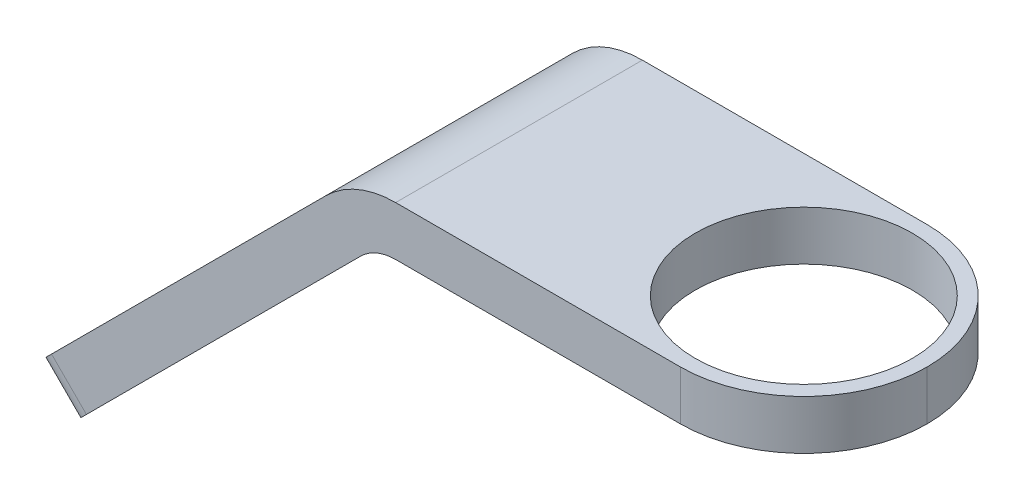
ISO-10303-21;
HEADER;
FILE_DESCRIPTION(('STEP AP214'),'2;1');
FILE_NAME('part.step','',(''),(''),'','','');
FILE_SCHEMA(('AUTOMOTIVE_DESIGN { 1 0 10303 214 1 1 1 1 }'));
ENDSEC;
DATA;
#1=APPLICATION_CONTEXT('core data for automotive mechanical design processes');
#2=APPLICATION_PROTOCOL_DEFINITION('international standard','automotive_design',2000,#1);
#3=PRODUCT_CONTEXT('',#1,'mechanical');
#4=PRODUCT('Part','Part','',(#3));
#5=PRODUCT_RELATED_PRODUCT_CATEGORY('part','',(#4));
#6=PRODUCT_DEFINITION_FORMATION('','',#4);
#7=PRODUCT_DEFINITION_CONTEXT('part definition',#1,'design');
#8=PRODUCT_DEFINITION('design','',#6,#7);
#9=PRODUCT_DEFINITION_SHAPE('','',#8);
#10=(LENGTH_UNIT() NAMED_UNIT(*) SI_UNIT(.MILLI.,.METRE.));
#11=(NAMED_UNIT(*) PLANE_ANGLE_UNIT() SI_UNIT($,.RADIAN.));
#12=(NAMED_UNIT(*) SI_UNIT($,.STERADIAN.) SOLID_ANGLE_UNIT());
#13=UNCERTAINTY_MEASURE_WITH_UNIT(LENGTH_MEASURE(1.E-05),#10,'distance_accuracy_value','');
#14=(GEOMETRIC_REPRESENTATION_CONTEXT(3) GLOBAL_UNCERTAINTY_ASSIGNED_CONTEXT((#13)) GLOBAL_UNIT_ASSIGNED_CONTEXT((#10,
#11,#12)) REPRESENTATION_CONTEXT('',''));
#15=CARTESIAN_POINT('',(0.,0.,0.));
#16=DIRECTION('',(0.,0.,1.));
#17=DIRECTION('',(1.,0.,0.));
#18=AXIS2_PLACEMENT_3D('',#15,#16,#17);
#19=CARTESIAN_POINT('',(0.,0.,50.));
#20=DIRECTION('',(0.707106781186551,0.707106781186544,0.));
#21=DIRECTION('',(-0.707106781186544,0.707106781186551,0.));
#22=AXIS2_PLACEMENT_3D('',#19,#20,#21);
#23=PLANE('',#22);
#24=DIRECTION('',(0.,0.,-1.));
#25=VECTOR('',#24,1.);
#26=CARTESIAN_POINT('',(0.,0.,50.));
#27=LINE('',#26,#25);
#28=CARTESIAN_POINT('',(0.,0.,45.));
#29=VERTEX_POINT('',#28);
#30=CARTESIAN_POINT('',(0.,0.,5.));
#31=VERTEX_POINT('',#30);
#32=EDGE_CURVE('E189',#29,#31,#27,.T.);
#33=ORIENTED_EDGE('',*,*,#32,.T.);
#34=DIRECTION('',(0.707106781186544,-0.707106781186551,0.));
#35=VECTOR('',#34,1.);
#36=CARTESIAN_POINT('',(0.,0.,5.));
#37=LINE('',#36,#35);
#38=CARTESIAN_POINT('',(7.07106781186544,-7.07106781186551,5.));
#39=VERTEX_POINT('',#38);
#40=EDGE_CURVE('E178',#31,#39,#37,.T.);
#41=ORIENTED_EDGE('',*,*,#40,.T.);
#42=DIRECTION('',(0.,0.,-1.));
#43=VECTOR('',#42,1.);
#44=CARTESIAN_POINT('',(7.07106781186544,-7.07106781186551,50.));
#45=LINE('',#44,#43);
#46=CARTESIAN_POINT('',(7.07106781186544,-7.07106781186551,45.));
#47=VERTEX_POINT('',#46);
#48=EDGE_CURVE('E196',#47,#39,#45,.T.);
#49=ORIENTED_EDGE('',*,*,#48,.F.);
#50=DIRECTION('',(0.707106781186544,-0.707106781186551,0.));
#51=VECTOR('',#50,1.);
#52=CARTESIAN_POINT('',(0.,0.,45.));
#53=LINE('',#52,#51);
#54=EDGE_CURVE('E176',#47,#29,#53,.F.);
#55=ORIENTED_EDGE('',*,*,#54,.T.);
#56=EDGE_LOOP('',(#33,#41,#49,#55));
#57=FACE_BOUND('',#56,.T.);
#58=ADVANCED_FACE('F33',(#57),#23,.F.);
#59=CARTESIAN_POINT('',(7.07106781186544,-7.07106781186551,50.));
#60=DIRECTION('',(-0.707106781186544,0.707106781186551,0.));
#61=DIRECTION('',(-0.707106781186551,-0.707106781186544,0.));
#62=AXIS2_PLACEMENT_3D('',#59,#60,#61);
#63=PLANE('',#62);
#64=ORIENTED_EDGE('',*,*,#48,.T.);
#65=CARTESIAN_POINT('',(10.6066017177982,-3.53553390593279,5.));
#66=DIRECTION('',(-0.707106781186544,0.707106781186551,0.));
#67=DIRECTION('',(-0.707106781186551,-0.707106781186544,0.));
#68=AXIS2_PLACEMENT_3D('',#65,#66,#67);
#69=CIRCLE('',#68,5.);
#70=CARTESIAN_POINT('',(10.6066017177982,-3.53553390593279,0.));
#71=VERTEX_POINT('',#70);
#72=EDGE_CURVE('E183',#39,#71,#69,.F.);
#73=ORIENTED_EDGE('',*,*,#72,.T.);
#74=DIRECTION('',(0.707106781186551,0.707106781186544,0.));
#75=VECTOR('',#74,1.);
#76=CARTESIAN_POINT('',(7.07106781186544,-7.07106781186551,0.));
#77=LINE('',#76,#75);
#78=CARTESIAN_POINT('',(66.2132034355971,52.0710678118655,0.));
#79=VERTEX_POINT('',#78);
#80=EDGE_CURVE('E156',#71,#79,#77,.T.);
#81=ORIENTED_EDGE('',*,*,#80,.T.);
#82=DIRECTION('',(0.,0.,-1.));
#83=VECTOR('',#82,1.);
#84=CARTESIAN_POINT('',(66.2132034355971,52.0710678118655,50.));
#85=LINE('',#84,#83);
#86=CARTESIAN_POINT('',(66.2132034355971,52.0710678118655,50.));
#87=VERTEX_POINT('',#86);
#88=EDGE_CURVE('E168',#79,#87,#85,.F.);
#89=ORIENTED_EDGE('',*,*,#88,.T.);
#90=DIRECTION('',(0.707106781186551,0.707106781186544,0.));
#91=VECTOR('',#90,1.);
#92=CARTESIAN_POINT('',(7.07106781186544,-7.07106781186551,50.));
#93=LINE('',#92,#91);
#94=CARTESIAN_POINT('',(10.6066017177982,-3.53553390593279,50.));
#95=VERTEX_POINT('',#94);
#96=EDGE_CURVE('E208',#95,#87,#93,.T.);
#97=ORIENTED_EDGE('',*,*,#96,.F.);
#98=CARTESIAN_POINT('',(10.6066017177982,-3.53553390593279,45.));
#99=DIRECTION('',(-0.707106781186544,0.707106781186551,0.));
#100=DIRECTION('',(-0.707106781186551,-0.707106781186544,0.));
#101=AXIS2_PLACEMENT_3D('',#98,#99,#100);
#102=CIRCLE('',#101,5.);
#103=EDGE_CURVE('E181',#95,#47,#102,.F.);
#104=ORIENTED_EDGE('',*,*,#103,.T.);
#105=EDGE_LOOP('',(#64,#73,#81,#89,#97,#104));
#106=FACE_BOUND('',#105,.T.);
#107=ADVANCED_FACE('F201',(#106),#63,.F.);
#108=CARTESIAN_POINT('',(156.000000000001,55.,50.));
#109=DIRECTION('',(0.,1.,0.));
#110=DIRECTION('',(-1.,0.,0.));
#111=AXIS2_PLACEMENT_3D('',#108,#109,#110);
#112=PLANE('',#111);
#113=CARTESIAN_POINT('',(131.000000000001,55.,25.));
#114=DIRECTION('',(0.,1.,0.));
#115=DIRECTION('',(-1.,0.,0.));
#116=AXIS2_PLACEMENT_3D('',#113,#114,#115);
#117=CIRCLE('',#116,22.);
#118=CARTESIAN_POINT('',(109.000000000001,55.,25.));
#119=VERTEX_POINT('',#118);
#120=EDGE_CURVE('E157',#119,#119,#117,.T.);
#121=ORIENTED_EDGE('',*,*,#120,.T.);
#122=EDGE_LOOP('',(#121));
#123=FACE_BOUND('',#122,.T.);
#124=DIRECTION('',(1.,0.,0.));
#125=VECTOR('',#124,1.);
#126=CARTESIAN_POINT('',(156.000000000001,55.,50.));
#127=LINE('',#126,#125);
#128=CARTESIAN_POINT('',(73.2842712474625,55.,50.));
#129=VERTEX_POINT('',#128);
#130=CARTESIAN_POINT('',(131.000000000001,55.,50.));
#131=VERTEX_POINT('',#130);
#132=EDGE_CURVE('E210',#129,#131,#127,.T.);
#133=ORIENTED_EDGE('',*,*,#132,.F.);
#134=DIRECTION('',(0.,0.,-1.));
#135=VECTOR('',#134,1.);
#136=CARTESIAN_POINT('',(73.2842712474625,55.,0.));
#137=LINE('',#136,#135);
#138=CARTESIAN_POINT('',(73.2842712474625,55.,0.));
#139=VERTEX_POINT('',#138);
#140=EDGE_CURVE('E165',#129,#139,#137,.T.);
#141=ORIENTED_EDGE('',*,*,#140,.T.);
#142=DIRECTION('',(1.,0.,0.));
#143=VECTOR('',#142,1.);
#144=CARTESIAN_POINT('',(156.000000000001,55.,0.));
#145=LINE('',#144,#143);
#146=CARTESIAN_POINT('',(131.000000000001,55.,0.));
#147=VERTEX_POINT('',#146);
#148=EDGE_CURVE('E139',#139,#147,#145,.T.);
#149=ORIENTED_EDGE('',*,*,#148,.T.);
#150=CARTESIAN_POINT('',(131.000000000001,55.,25.));
#151=DIRECTION('',(0.,1.,0.));
#152=DIRECTION('',(-1.,0.,0.));
#153=AXIS2_PLACEMENT_3D('',#150,#151,#152);
#154=CIRCLE('',#153,25.);
#155=CARTESIAN_POINT('',(156.000000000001,55.,25.));
#156=VERTEX_POINT('',#155);
#157=EDGE_CURVE('E143',#147,#156,#154,.F.);
#158=ORIENTED_EDGE('',*,*,#157,.T.);
#159=CARTESIAN_POINT('',(131.000000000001,55.,25.));
#160=DIRECTION('',(0.,1.,0.));
#161=DIRECTION('',(-1.,0.,0.));
#162=AXIS2_PLACEMENT_3D('',#159,#160,#161);
#163=CIRCLE('',#162,25.);
#164=EDGE_CURVE('E144',#156,#131,#163,.F.);
#165=ORIENTED_EDGE('',*,*,#164,.T.);
#166=EDGE_LOOP('',(#133,#141,#149,#158,#165));
#167=FACE_BOUND('',#166,.T.);
#168=ADVANCED_FACE('F230',(#123,#167),#112,.F.);
#169=CARTESIAN_POINT('',(156.000000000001,65.,50.));
#170=DIRECTION('',(0.,-1.,0.));
#171=DIRECTION('',(1.,0.,0.));
#172=AXIS2_PLACEMENT_3D('',#169,#170,#171);
#173=PLANE('',#172);
#174=CARTESIAN_POINT('',(131.000000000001,65.,25.));
#175=DIRECTION('',(0.,1.,0.));
#176=DIRECTION('',(0.,0.,1.));
#177=AXIS2_PLACEMENT_3D('',#174,#175,#176);
#178=CIRCLE('',#177,22.);
#179=CARTESIAN_POINT('',(131.000000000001,65.,47.));
#180=VERTEX_POINT('',#179);
#181=EDGE_CURVE('E278',#180,#180,#178,.T.);
#182=ORIENTED_EDGE('',*,*,#181,.F.);
#183=EDGE_LOOP('',(#182));
#184=FACE_BOUND('',#183,.T.);
#185=DIRECTION('',(-1.,0.,0.));
#186=VECTOR('',#185,1.);
#187=CARTESIAN_POINT('',(156.000000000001,65.,0.));
#188=LINE('',#187,#186);
#189=CARTESIAN_POINT('',(131.000000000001,65.,0.));
#190=VERTEX_POINT('',#189);
#191=CARTESIAN_POINT('',(73.2842712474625,65.,0.));
#192=VERTEX_POINT('',#191);
#193=EDGE_CURVE('E123',#190,#192,#188,.T.);
#194=ORIENTED_EDGE('',*,*,#193,.T.);
#195=DIRECTION('',(0.,0.,-1.));
#196=VECTOR('',#195,1.);
#197=CARTESIAN_POINT('',(73.2842712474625,65.,50.));
#198=LINE('',#197,#196);
#199=CARTESIAN_POINT('',(73.2842712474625,65.,50.));
#200=VERTEX_POINT('',#199);
#201=EDGE_CURVE('E161',#192,#200,#198,.F.);
#202=ORIENTED_EDGE('',*,*,#201,.T.);
#203=DIRECTION('',(-1.,0.,0.));
#204=VECTOR('',#203,1.);
#205=CARTESIAN_POINT('',(156.000000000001,65.,50.));
#206=LINE('',#205,#204);
#207=CARTESIAN_POINT('',(131.000000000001,65.,50.));
#208=VERTEX_POINT('',#207);
#209=EDGE_CURVE('E214',#208,#200,#206,.T.);
#210=ORIENTED_EDGE('',*,*,#209,.F.);
#211=CARTESIAN_POINT('',(131.000000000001,65.,25.));
#212=DIRECTION('',(0.,-1.,0.));
#213=DIRECTION('',(1.,0.,0.));
#214=AXIS2_PLACEMENT_3D('',#211,#212,#213);
#215=CIRCLE('',#214,25.);
#216=CARTESIAN_POINT('',(156.000000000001,65.,25.));
#217=VERTEX_POINT('',#216);
#218=EDGE_CURVE('E127',#208,#217,#215,.F.);
#219=ORIENTED_EDGE('',*,*,#218,.T.);
#220=CARTESIAN_POINT('',(131.000000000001,65.,25.));
#221=DIRECTION('',(0.,-1.,0.));
#222=DIRECTION('',(1.,0.,0.));
#223=AXIS2_PLACEMENT_3D('',#220,#221,#222);
#224=CIRCLE('',#223,25.);
#225=EDGE_CURVE('E120',#217,#190,#224,.F.);
#226=ORIENTED_EDGE('',*,*,#225,.T.);
#227=EDGE_LOOP('',(#194,#202,#210,#219,#226));
#228=FACE_BOUND('',#227,.T.);
#229=ADVANCED_FACE('F122',(#184,#228),#173,.F.);
#230=CARTESIAN_POINT('',(0.,0.,50.));
#231=DIRECTION('',(0.707106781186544,-0.707106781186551,0.));
#232=DIRECTION('',(0.707106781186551,0.707106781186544,0.));
#233=AXIS2_PLACEMENT_3D('',#230,#231,#232);
#234=PLANE('',#233);
#235=DIRECTION('',(-0.707106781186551,-0.707106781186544,0.));
#236=VECTOR('',#235,1.);
#237=CARTESIAN_POINT('',(0.,0.,0.));
#238=LINE('',#237,#236);
#239=CARTESIAN_POINT('',(59.1421356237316,59.142135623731,0.));
#240=VERTEX_POINT('',#239);
#241=CARTESIAN_POINT('',(3.53553390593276,3.53553390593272,0.));
#242=VERTEX_POINT('',#241);
#243=EDGE_CURVE('E138',#240,#242,#238,.T.);
#244=ORIENTED_EDGE('',*,*,#243,.T.);
#245=CARTESIAN_POINT('',(3.53553390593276,3.53553390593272,5.));
#246=DIRECTION('',(0.707106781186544,-0.707106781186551,0.));
#247=DIRECTION('',(0.707106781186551,0.707106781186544,0.));
#248=AXIS2_PLACEMENT_3D('',#245,#246,#247);
#249=CIRCLE('',#248,5.);
#250=EDGE_CURVE('E41',#242,#31,#249,.F.);
#251=ORIENTED_EDGE('',*,*,#250,.T.);
#252=ORIENTED_EDGE('',*,*,#32,.F.);
#253=CARTESIAN_POINT('',(3.53553390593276,3.53553390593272,45.));
#254=DIRECTION('',(0.707106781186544,-0.707106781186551,0.));
#255=DIRECTION('',(0.707106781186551,0.707106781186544,0.));
#256=AXIS2_PLACEMENT_3D('',#253,#254,#255);
#257=CIRCLE('',#256,5.);
#258=CARTESIAN_POINT('',(3.53553390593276,3.53553390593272,50.));
#259=VERTEX_POINT('',#258);
#260=EDGE_CURVE('E48',#29,#259,#257,.F.);
#261=ORIENTED_EDGE('',*,*,#260,.T.);
#262=DIRECTION('',(-0.707106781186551,-0.707106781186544,0.));
#263=VECTOR('',#262,1.);
#264=CARTESIAN_POINT('',(0.,0.,50.));
#265=LINE('',#264,#263);
#266=CARTESIAN_POINT('',(59.1421356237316,59.142135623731,50.));
#267=VERTEX_POINT('',#266);
#268=EDGE_CURVE('E197',#267,#259,#265,.T.);
#269=ORIENTED_EDGE('',*,*,#268,.F.);
#270=DIRECTION('',(0.,0.,-1.));
#271=VECTOR('',#270,1.);
#272=CARTESIAN_POINT('',(59.1421356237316,59.142135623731,50.));
#273=LINE('',#272,#271);
#274=EDGE_CURVE('E153',#267,#240,#273,.T.);
#275=ORIENTED_EDGE('',*,*,#274,.T.);
#276=EDGE_LOOP('',(#244,#251,#252,#261,#269,#275));
#277=FACE_BOUND('',#276,.T.);
#278=ADVANCED_FACE('F188',(#277),#234,.F.);
#279=CARTESIAN_POINT('',(0.,0.,50.));
#280=DIRECTION('',(0.,0.,1.));
#281=DIRECTION('',(1.,0.,0.));
#282=AXIS2_PLACEMENT_3D('',#279,#280,#281);
#283=PLANE('',#282);
#284=ORIENTED_EDGE('',*,*,#268,.T.);
#285=DIRECTION('',(0.707106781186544,-0.707106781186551,0.));
#286=VECTOR('',#285,1.);
#287=CARTESIAN_POINT('',(10.6066017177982,-3.53553390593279,50.));
#288=LINE('',#287,#286);
#289=EDGE_CURVE('E11',#259,#95,#288,.T.);
#290=ORIENTED_EDGE('',*,*,#289,.T.);
#291=ORIENTED_EDGE('',*,*,#96,.T.);
#292=CARTESIAN_POINT('',(73.2842712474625,45.,50.));
#293=DIRECTION('',(0.,0.,1.));
#294=DIRECTION('',(1.,0.,0.));
#295=AXIS2_PLACEMENT_3D('',#292,#293,#294);
#296=CIRCLE('',#295,10.);
#297=EDGE_CURVE('E174',#87,#129,#296,.F.);
#298=ORIENTED_EDGE('',*,*,#297,.T.);
#299=ORIENTED_EDGE('',*,*,#132,.T.);
#300=DIRECTION('',(0.,1.,0.));
#301=VECTOR('',#300,1.);
#302=CARTESIAN_POINT('',(131.000000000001,65.,50.));
#303=LINE('',#302,#301);
#304=EDGE_CURVE('E151',#131,#208,#303,.T.);
#305=ORIENTED_EDGE('',*,*,#304,.T.);
#306=ORIENTED_EDGE('',*,*,#209,.T.);
#307=CARTESIAN_POINT('',(73.2842712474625,45.,50.));
#308=DIRECTION('',(0.,0.,1.));
#309=DIRECTION('',(1.,0.,0.));
#310=AXIS2_PLACEMENT_3D('',#307,#308,#309);
#311=CIRCLE('',#310,20.);
#312=EDGE_CURVE('E163',#200,#267,#311,.T.);
#313=ORIENTED_EDGE('',*,*,#312,.T.);
#314=EDGE_LOOP('',(#284,#290,#291,#298,#299,#305,#306,#313));
#315=FACE_BOUND('',#314,.T.);
#316=ADVANCED_FACE('F221',(#315),#283,.T.);
#317=CARTESIAN_POINT('',(0.,0.,0.));
#318=DIRECTION('',(0.,0.,1.));
#319=DIRECTION('',(1.,0.,0.));
#320=AXIS2_PLACEMENT_3D('',#317,#318,#319);
#321=PLANE('',#320);
#322=ORIENTED_EDGE('',*,*,#80,.F.);
#323=DIRECTION('',(0.707106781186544,-0.707106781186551,0.));
#324=VECTOR('',#323,1.);
#325=CARTESIAN_POINT('',(3.53553390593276,3.53553390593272,0.));
#326=LINE('',#325,#324);
#327=EDGE_CURVE('E56',#71,#242,#326,.F.);
#328=ORIENTED_EDGE('',*,*,#327,.T.);
#329=ORIENTED_EDGE('',*,*,#243,.F.);
#330=CARTESIAN_POINT('',(73.2842712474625,45.,0.));
#331=DIRECTION('',(0.,0.,1.));
#332=DIRECTION('',(1.,0.,0.));
#333=AXIS2_PLACEMENT_3D('',#330,#331,#332);
#334=CIRCLE('',#333,20.);
#335=EDGE_CURVE('E137',#240,#192,#334,.F.);
#336=ORIENTED_EDGE('',*,*,#335,.T.);
#337=ORIENTED_EDGE('',*,*,#193,.F.);
#338=DIRECTION('',(0.,1.,0.));
#339=VECTOR('',#338,1.);
#340=CARTESIAN_POINT('',(131.000000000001,0.,0.));
#341=LINE('',#340,#339);
#342=EDGE_CURVE('E132',#190,#147,#341,.F.);
#343=ORIENTED_EDGE('',*,*,#342,.T.);
#344=ORIENTED_EDGE('',*,*,#148,.F.);
#345=CARTESIAN_POINT('',(73.2842712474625,45.,0.));
#346=DIRECTION('',(0.,0.,1.));
#347=DIRECTION('',(1.,0.,0.));
#348=AXIS2_PLACEMENT_3D('',#345,#346,#347);
#349=CIRCLE('',#348,10.);
#350=EDGE_CURVE('E171',#139,#79,#349,.T.);
#351=ORIENTED_EDGE('',*,*,#350,.T.);
#352=EDGE_LOOP('',(#322,#328,#329,#336,#337,#343,#344,#351));
#353=FACE_BOUND('',#352,.T.);
#354=ADVANCED_FACE('F135',(#353),#321,.F.);
#355=CARTESIAN_POINT('',(131.000000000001,0.,25.));
#356=DIRECTION('',(0.,-1.,0.));
#357=DIRECTION('',(0.,0.,-1.));
#358=AXIS2_PLACEMENT_3D('',#355,#356,#357);
#359=CYLINDRICAL_SURFACE('',#358,25.);
#360=ORIENTED_EDGE('',*,*,#304,.F.);
#361=ORIENTED_EDGE('',*,*,#164,.F.);
#362=DIRECTION('',(0.,1.,0.));
#363=VECTOR('',#362,1.);
#364=CARTESIAN_POINT('',(156.000000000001,55.,25.));
#365=LINE('',#364,#363);
#366=EDGE_CURVE('E154',#217,#156,#365,.F.);
#367=ORIENTED_EDGE('',*,*,#366,.F.);
#368=ORIENTED_EDGE('',*,*,#218,.F.);
#369=EDGE_LOOP('',(#360,#361,#367,#368));
#370=FACE_BOUND('',#369,.T.);
#371=ADVANCED_FACE('F234',(#370),#359,.T.);
#372=CARTESIAN_POINT('',(131.000000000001,65.,25.));
#373=DIRECTION('',(0.,1.,0.));
#374=DIRECTION('',(0.,0.,1.));
#375=AXIS2_PLACEMENT_3D('',#372,#373,#374);
#376=CYLINDRICAL_SURFACE('',#375,25.);
#377=ORIENTED_EDGE('',*,*,#157,.F.);
#378=ORIENTED_EDGE('',*,*,#342,.F.);
#379=ORIENTED_EDGE('',*,*,#225,.F.);
#380=ORIENTED_EDGE('',*,*,#366,.T.);
#381=EDGE_LOOP('',(#377,#378,#379,#380));
#382=FACE_BOUND('',#381,.T.);
#383=ADVANCED_FACE('F142',(#382),#376,.T.);
#384=CARTESIAN_POINT('',(131.000000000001,-7.07106781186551,25.));
#385=DIRECTION('',(0.,1.,0.));
#386=DIRECTION('',(0.,0.,1.));
#387=AXIS2_PLACEMENT_3D('',#384,#385,#386);
#388=CYLINDRICAL_SURFACE('',#387,22.);
#389=ORIENTED_EDGE('',*,*,#181,.T.);
#390=EDGE_LOOP('',(#389));
#391=FACE_BOUND('',#390,.T.);
#392=ORIENTED_EDGE('',*,*,#120,.F.);
#393=EDGE_LOOP('',(#392));
#394=FACE_BOUND('',#393,.T.);
#395=ADVANCED_FACE('F238',(#391,#394),#388,.F.);
#396=CARTESIAN_POINT('',(73.2842712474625,45.,50.));
#397=DIRECTION('',(0.,0.,-1.));
#398=DIRECTION('',(-1.,0.,0.));
#399=AXIS2_PLACEMENT_3D('',#396,#397,#398);
#400=CYLINDRICAL_SURFACE('',#399,20.);
#401=ORIENTED_EDGE('',*,*,#312,.F.);
#402=ORIENTED_EDGE('',*,*,#201,.F.);
#403=ORIENTED_EDGE('',*,*,#335,.F.);
#404=ORIENTED_EDGE('',*,*,#274,.F.);
#405=EDGE_LOOP('',(#401,#402,#403,#404));
#406=FACE_BOUND('',#405,.T.);
#407=ADVANCED_FACE('F236',(#406),#400,.T.);
#408=CARTESIAN_POINT('',(73.2842712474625,45.,50.));
#409=DIRECTION('',(0.,0.,1.));
#410=DIRECTION('',(1.,0.,0.));
#411=AXIS2_PLACEMENT_3D('',#408,#409,#410);
#412=CYLINDRICAL_SURFACE('',#411,10.);
#413=ORIENTED_EDGE('',*,*,#297,.F.);
#414=ORIENTED_EDGE('',*,*,#88,.F.);
#415=ORIENTED_EDGE('',*,*,#350,.F.);
#416=ORIENTED_EDGE('',*,*,#140,.F.);
#417=EDGE_LOOP('',(#413,#414,#415,#416));
#418=FACE_BOUND('',#417,.T.);
#419=ADVANCED_FACE('F227',(#418),#412,.F.);
#420=CARTESIAN_POINT('',(3.53553390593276,3.53553390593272,5.));
#421=DIRECTION('',(0.707106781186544,-0.707106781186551,0.));
#422=DIRECTION('',(0.707106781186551,0.707106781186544,0.));
#423=AXIS2_PLACEMENT_3D('',#420,#421,#422);
#424=CYLINDRICAL_SURFACE('',#423,5.);
#425=ORIENTED_EDGE('',*,*,#250,.F.);
#426=ORIENTED_EDGE('',*,*,#327,.F.);
#427=ORIENTED_EDGE('',*,*,#72,.F.);
#428=ORIENTED_EDGE('',*,*,#40,.F.);
#429=EDGE_LOOP('',(#425,#426,#427,#428));
#430=FACE_BOUND('',#429,.T.);
#431=ADVANCED_FACE('F199',(#430),#424,.T.);
#432=CARTESIAN_POINT('',(3.53553390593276,3.53553390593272,45.));
#433=DIRECTION('',(-0.707106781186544,0.707106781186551,0.));
#434=DIRECTION('',(-0.707106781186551,-0.707106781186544,0.));
#435=AXIS2_PLACEMENT_3D('',#432,#433,#434);
#436=CYLINDRICAL_SURFACE('',#435,5.);
#437=ORIENTED_EDGE('',*,*,#260,.F.);
#438=ORIENTED_EDGE('',*,*,#54,.F.);
#439=ORIENTED_EDGE('',*,*,#103,.F.);
#440=ORIENTED_EDGE('',*,*,#289,.F.);
#441=EDGE_LOOP('',(#437,#438,#439,#440));
#442=FACE_BOUND('',#441,.T.);
#443=ADVANCED_FACE('F35',(#442),#436,.T.);
#444=CLOSED_SHELL('',(#58,#107,#168,#229,#278,#316,#354,#371,#383,#395,#407,#419,#431,#443));
#445=MANIFOLD_SOLID_BREP('B2',#444);
#446=ADVANCED_BREP_SHAPE_REPRESENTATION('',(#18,#445),#14);
#447=SHAPE_DEFINITION_REPRESENTATION(#9,#446);
ENDSEC;
END-ISO-10303-21;
